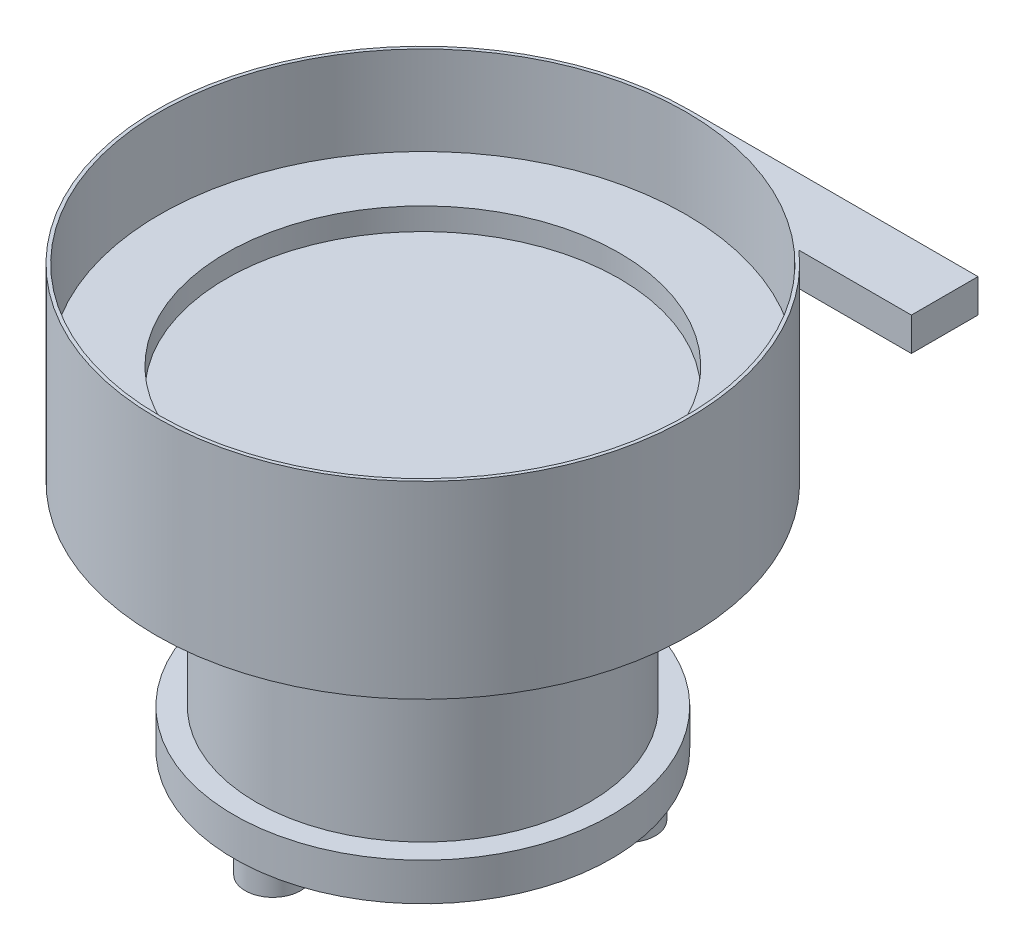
ISO-10303-21;
HEADER;
FILE_DESCRIPTION(('STEP AP214'),'2;1');
FILE_NAME('part.step','',(''),(''),'','','');
FILE_SCHEMA(('AUTOMOTIVE_DESIGN { 1 0 10303 214 1 1 1 1 }'));
ENDSEC;
DATA;
#1=APPLICATION_CONTEXT('core data for automotive mechanical design processes');
#2=APPLICATION_PROTOCOL_DEFINITION('international standard','automotive_design',2000,#1);
#3=PRODUCT_CONTEXT('',#1,'mechanical');
#4=PRODUCT('Part','Part','',(#3));
#5=PRODUCT_RELATED_PRODUCT_CATEGORY('part','',(#4));
#6=PRODUCT_DEFINITION_FORMATION('','',#4);
#7=PRODUCT_DEFINITION_CONTEXT('part definition',#1,'design');
#8=PRODUCT_DEFINITION('design','',#6,#7);
#9=PRODUCT_DEFINITION_SHAPE('','',#8);
#10=(LENGTH_UNIT() NAMED_UNIT(*) SI_UNIT(.MILLI.,.METRE.));
#11=(NAMED_UNIT(*) PLANE_ANGLE_UNIT() SI_UNIT($,.RADIAN.));
#12=(NAMED_UNIT(*) SI_UNIT($,.STERADIAN.) SOLID_ANGLE_UNIT());
#13=UNCERTAINTY_MEASURE_WITH_UNIT(LENGTH_MEASURE(1.E-05),#10,'distance_accuracy_value','');
#14=(GEOMETRIC_REPRESENTATION_CONTEXT(3) GLOBAL_UNCERTAINTY_ASSIGNED_CONTEXT((#13)) GLOBAL_UNIT_ASSIGNED_CONTEXT((#10,
#11,#12)) REPRESENTATION_CONTEXT('',''));
#15=CARTESIAN_POINT('',(0.,0.,0.));
#16=DIRECTION('',(0.,0.,1.));
#17=DIRECTION('',(1.,0.,0.));
#18=AXIS2_PLACEMENT_3D('',#15,#16,#17);
#19=CARTESIAN_POINT('',(0.,0.,0.));
#20=DIRECTION('',(0.,-1.,0.));
#21=DIRECTION('',(0.,0.,-1.));
#22=AXIS2_PLACEMENT_3D('',#19,#20,#21);
#23=CYLINDRICAL_SURFACE('',#22,240.);
#24=CARTESIAN_POINT('',(0.,209.,0.));
#25=DIRECTION('',(0.,-1.,0.));
#26=DIRECTION('',(0.,0.,-1.));
#27=AXIS2_PLACEMENT_3D('',#24,#25,#26);
#28=CIRCLE('',#27,240.);
#29=CARTESIAN_POINT('',(0.,209.,-240.));
#30=VERTEX_POINT('',#29);
#31=EDGE_CURVE('E114',#30,#30,#28,.T.);
#32=ORIENTED_EDGE('',*,*,#31,.F.);
#33=EDGE_LOOP('',(#32));
#34=FACE_BOUND('',#33,.T.);
#35=CARTESIAN_POINT('',(0.,349.,0.));
#36=DIRECTION('',(0.,1.,0.));
#37=DIRECTION('',(0.,0.,1.));
#38=AXIS2_PLACEMENT_3D('',#35,#36,#37);
#39=CIRCLE('',#38,240.);
#40=CARTESIAN_POINT('',(0.,349.,-240.));
#41=VERTEX_POINT('',#40);
#42=CARTESIAN_POINT('',(158.745078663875,349.,-180.));
#43=VERTEX_POINT('',#42);
#44=EDGE_CURVE('E73',#41,#43,#39,.F.);
#45=ORIENTED_EDGE('',*,*,#44,.T.);
#46=DIRECTION('',(0.,-1.,0.));
#47=VECTOR('',#46,1.);
#48=CARTESIAN_POINT('',(158.745078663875,0.,-180.));
#49=LINE('',#48,#47);
#50=CARTESIAN_POINT('',(158.745078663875,379.,-180.));
#51=VERTEX_POINT('',#50);
#52=EDGE_CURVE('E38',#43,#51,#49,.F.);
#53=ORIENTED_EDGE('',*,*,#52,.T.);
#54=CARTESIAN_POINT('',(0.,379.,0.));
#55=DIRECTION('',(0.,-1.,0.));
#56=DIRECTION('',(0.,0.,-1.));
#57=AXIS2_PLACEMENT_3D('',#54,#55,#56);
#58=CIRCLE('',#57,240.);
#59=CARTESIAN_POINT('',(0.,379.,-240.));
#60=VERTEX_POINT('',#59);
#61=EDGE_CURVE('E109',#51,#60,#58,.T.);
#62=ORIENTED_EDGE('',*,*,#61,.T.);
#63=DIRECTION('',(0.,1.,0.));
#64=VECTOR('',#63,1.);
#65=CARTESIAN_POINT('',(0.,379.,-240.));
#66=LINE('',#65,#64);
#67=EDGE_CURVE('E70',#41,#60,#66,.T.);
#68=ORIENTED_EDGE('',*,*,#67,.F.);
#69=EDGE_LOOP('',(#45,#53,#62,#68));
#70=FACE_BOUND('',#69,.T.);
#71=ADVANCED_FACE('F15',(#34,#70),#23,.T.);
#72=CARTESIAN_POINT('',(0.,299.,0.));
#73=DIRECTION('',(0.,1.,0.));
#74=DIRECTION('',(0.,0.,1.));
#75=AXIS2_PLACEMENT_3D('',#72,#73,#74);
#76=CYLINDRICAL_SURFACE('',#75,237.);
#77=CARTESIAN_POINT('',(0.,299.,0.));
#78=DIRECTION('',(0.,1.,0.));
#79=DIRECTION('',(0.,0.,1.));
#80=AXIS2_PLACEMENT_3D('',#77,#78,#79);
#81=CIRCLE('',#80,237.);
#82=CARTESIAN_POINT('',(0.,299.,237.));
#83=VERTEX_POINT('',#82);
#84=EDGE_CURVE('E88',#83,#83,#81,.T.);
#85=ORIENTED_EDGE('',*,*,#84,.F.);
#86=EDGE_LOOP('',(#85));
#87=FACE_BOUND('',#86,.T.);
#88=CARTESIAN_POINT('',(0.,379.,0.));
#89=DIRECTION('',(0.,1.,0.));
#90=DIRECTION('',(0.,0.,1.));
#91=AXIS2_PLACEMENT_3D('',#88,#89,#90);
#92=CIRCLE('',#91,237.);
#93=CARTESIAN_POINT('',(0.,379.,237.));
#94=VERTEX_POINT('',#93);
#95=EDGE_CURVE('E85',#94,#94,#92,.T.);
#96=ORIENTED_EDGE('',*,*,#95,.T.);
#97=EDGE_LOOP('',(#96));
#98=FACE_BOUND('',#97,.T.);
#99=ADVANCED_FACE('F143',(#87,#98),#76,.F.);
#100=CARTESIAN_POINT('',(0.,0.,0.));
#101=DIRECTION('',(0.,-1.,0.));
#102=DIRECTION('',(0.,0.,-1.));
#103=AXIS2_PLACEMENT_3D('',#100,#101,#102);
#104=PLANE('',#103);
#105=CARTESIAN_POINT('',(-116.913429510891,0.,-67.500000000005));
#106=DIRECTION('',(0.,-1.,0.));
#107=DIRECTION('',(0.,0.,-1.));
#108=AXIS2_PLACEMENT_3D('',#105,#106,#107);
#109=CIRCLE('',#108,25.);
#110=CARTESIAN_POINT('',(-116.913429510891,0.,-92.500000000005));
#111=VERTEX_POINT('',#110);
#112=EDGE_CURVE('E91',#111,#111,#109,.T.);
#113=ORIENTED_EDGE('',*,*,#112,.F.);
#114=EDGE_LOOP('',(#113));
#115=FACE_BOUND('',#114,.T.);
#116=CARTESIAN_POINT('',(116.913429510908,0.,-67.499999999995));
#117=DIRECTION('',(0.,-1.,0.));
#118=DIRECTION('',(0.,0.,-1.));
#119=AXIS2_PLACEMENT_3D('',#116,#117,#118);
#120=CIRCLE('',#119,25.);
#121=CARTESIAN_POINT('',(116.913429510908,0.,-92.499999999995));
#122=VERTEX_POINT('',#121);
#123=EDGE_CURVE('E97',#122,#122,#120,.T.);
#124=ORIENTED_EDGE('',*,*,#123,.F.);
#125=EDGE_LOOP('',(#124));
#126=FACE_BOUND('',#125,.T.);
#127=CARTESIAN_POINT('',(0.,0.,135.));
#128=DIRECTION('',(0.,-1.,0.));
#129=DIRECTION('',(0.,0.,-1.));
#130=AXIS2_PLACEMENT_3D('',#127,#128,#129);
#131=CIRCLE('',#130,25.);
#132=CARTESIAN_POINT('',(0.,0.,110.));
#133=VERTEX_POINT('',#132);
#134=EDGE_CURVE('E103',#133,#133,#131,.T.);
#135=ORIENTED_EDGE('',*,*,#134,.F.);
#136=EDGE_LOOP('',(#135));
#137=FACE_BOUND('',#136,.T.);
#138=CARTESIAN_POINT('',(0.,0.,0.));
#139=DIRECTION('',(0.,-1.,0.));
#140=DIRECTION('',(0.,0.,-1.));
#141=AXIS2_PLACEMENT_3D('',#138,#139,#140);
#142=CIRCLE('',#141,170.);
#143=CARTESIAN_POINT('',(0.,0.,-170.));
#144=VERTEX_POINT('',#143);
#145=EDGE_CURVE('E10',#144,#144,#142,.T.);
#146=ORIENTED_EDGE('',*,*,#145,.T.);
#147=EDGE_LOOP('',(#146));
#148=FACE_BOUND('',#147,.T.);
#149=ADVANCED_FACE('F17',(#115,#126,#137,#148),#104,.T.);
#150=CARTESIAN_POINT('',(0.,0.,0.));
#151=DIRECTION('',(0.,-1.,0.));
#152=DIRECTION('',(0.,0.,-1.));
#153=AXIS2_PLACEMENT_3D('',#150,#151,#152);
#154=CYLINDRICAL_SURFACE('',#153,170.);
#155=CARTESIAN_POINT('',(0.,34.,0.));
#156=DIRECTION('',(0.,-1.,0.));
#157=DIRECTION('',(0.,0.,-1.));
#158=AXIS2_PLACEMENT_3D('',#155,#156,#157);
#159=CIRCLE('',#158,170.);
#160=CARTESIAN_POINT('',(0.,34.,-170.));
#161=VERTEX_POINT('',#160);
#162=EDGE_CURVE('E23',#161,#161,#159,.T.);
#163=ORIENTED_EDGE('',*,*,#162,.T.);
#164=EDGE_LOOP('',(#163));
#165=FACE_BOUND('',#164,.T.);
#166=ORIENTED_EDGE('',*,*,#145,.F.);
#167=EDGE_LOOP('',(#166));
#168=FACE_BOUND('',#167,.T.);
#169=ADVANCED_FACE('F125',(#165,#168),#154,.T.);
#170=CARTESIAN_POINT('',(170.,34.,0.));
#171=DIRECTION('',(0.,1.,0.));
#172=DIRECTION('',(0.,0.,1.));
#173=AXIS2_PLACEMENT_3D('',#170,#171,#172);
#174=PLANE('',#173);
#175=CARTESIAN_POINT('',(0.,34.,0.));
#176=DIRECTION('',(0.,-1.,0.));
#177=DIRECTION('',(0.,0.,-1.));
#178=AXIS2_PLACEMENT_3D('',#175,#176,#177);
#179=CIRCLE('',#178,150.);
#180=CARTESIAN_POINT('',(0.,34.,-150.));
#181=VERTEX_POINT('',#180);
#182=EDGE_CURVE('E120',#181,#181,#179,.T.);
#183=ORIENTED_EDGE('',*,*,#182,.T.);
#184=EDGE_LOOP('',(#183));
#185=FACE_BOUND('',#184,.T.);
#186=ORIENTED_EDGE('',*,*,#162,.F.);
#187=EDGE_LOOP('',(#186));
#188=FACE_BOUND('',#187,.T.);
#189=ADVANCED_FACE('F128',(#185,#188),#174,.T.);
#190=CARTESIAN_POINT('',(0.,0.,0.));
#191=DIRECTION('',(0.,-1.,0.));
#192=DIRECTION('',(0.,0.,-1.));
#193=AXIS2_PLACEMENT_3D('',#190,#191,#192);
#194=CYLINDRICAL_SURFACE('',#193,150.);
#195=CARTESIAN_POINT('',(0.,209.,0.));
#196=DIRECTION('',(0.,-1.,0.));
#197=DIRECTION('',(0.,0.,-1.));
#198=AXIS2_PLACEMENT_3D('',#195,#196,#197);
#199=CIRCLE('',#198,150.);
#200=CARTESIAN_POINT('',(0.,209.,-150.));
#201=VERTEX_POINT('',#200);
#202=EDGE_CURVE('E117',#201,#201,#199,.T.);
#203=ORIENTED_EDGE('',*,*,#202,.T.);
#204=EDGE_LOOP('',(#203));
#205=FACE_BOUND('',#204,.T.);
#206=ORIENTED_EDGE('',*,*,#182,.F.);
#207=EDGE_LOOP('',(#206));
#208=FACE_BOUND('',#207,.T.);
#209=ADVANCED_FACE('F130',(#205,#208),#194,.T.);
#210=CARTESIAN_POINT('',(150.,209.,0.));
#211=DIRECTION('',(0.,-1.,0.));
#212=DIRECTION('',(0.,0.,-1.));
#213=AXIS2_PLACEMENT_3D('',#210,#211,#212);
#214=PLANE('',#213);
#215=ORIENTED_EDGE('',*,*,#31,.T.);
#216=EDGE_LOOP('',(#215));
#217=FACE_BOUND('',#216,.T.);
#218=ORIENTED_EDGE('',*,*,#202,.F.);
#219=EDGE_LOOP('',(#218));
#220=FACE_BOUND('',#219,.T.);
#221=ADVANCED_FACE('F139',(#217,#220),#214,.T.);
#222=CARTESIAN_POINT('',(240.,379.,0.));
#223=DIRECTION('',(0.,1.,0.));
#224=DIRECTION('',(0.,0.,1.));
#225=AXIS2_PLACEMENT_3D('',#222,#223,#224);
#226=PLANE('',#225);
#227=ORIENTED_EDGE('',*,*,#95,.F.);
#228=EDGE_LOOP('',(#227));
#229=FACE_BOUND('',#228,.T.);
#230=ORIENTED_EDGE('',*,*,#61,.F.);
#231=DIRECTION('',(-1.,0.,0.));
#232=VECTOR('',#231,1.);
#233=CARTESIAN_POINT('',(260.,379.,-180.));
#234=LINE('',#233,#232);
#235=CARTESIAN_POINT('',(260.,379.,-180.));
#236=VERTEX_POINT('',#235);
#237=EDGE_CURVE('E180',#236,#51,#234,.T.);
#238=ORIENTED_EDGE('',*,*,#237,.F.);
#239=DIRECTION('',(0.,0.,1.));
#240=VECTOR('',#239,1.);
#241=CARTESIAN_POINT('',(260.,379.,-180.));
#242=LINE('',#241,#240);
#243=CARTESIAN_POINT('',(260.,379.,-240.));
#244=VERTEX_POINT('',#243);
#245=EDGE_CURVE('E68',#244,#236,#242,.T.);
#246=ORIENTED_EDGE('',*,*,#245,.F.);
#247=DIRECTION('',(-1.,0.,0.));
#248=VECTOR('',#247,1.);
#249=CARTESIAN_POINT('',(260.,379.,-240.));
#250=LINE('',#249,#248);
#251=EDGE_CURVE('E76',#244,#60,#250,.T.);
#252=ORIENTED_EDGE('',*,*,#251,.T.);
#253=EDGE_LOOP('',(#230,#238,#246,#252));
#254=FACE_BOUND('',#253,.T.);
#255=ADVANCED_FACE('F156',(#229,#254),#226,.T.);
#256=CARTESIAN_POINT('',(0.,-30.,135.));
#257=DIRECTION('',(0.,1.,0.));
#258=DIRECTION('',(0.,0.,1.));
#259=AXIS2_PLACEMENT_3D('',#256,#257,#258);
#260=CYLINDRICAL_SURFACE('',#259,25.);
#261=CARTESIAN_POINT('',(0.,-30.,135.));
#262=DIRECTION('',(0.,-1.,0.));
#263=DIRECTION('',(0.,0.,-1.));
#264=AXIS2_PLACEMENT_3D('',#261,#262,#263);
#265=CIRCLE('',#264,25.);
#266=CARTESIAN_POINT('',(0.,-30.,110.));
#267=VERTEX_POINT('',#266);
#268=EDGE_CURVE('E106',#267,#267,#265,.T.);
#269=ORIENTED_EDGE('',*,*,#268,.F.);
#270=EDGE_LOOP('',(#269));
#271=FACE_BOUND('',#270,.T.);
#272=ORIENTED_EDGE('',*,*,#134,.T.);
#273=EDGE_LOOP('',(#272));
#274=FACE_BOUND('',#273,.T.);
#275=ADVANCED_FACE('F164',(#271,#274),#260,.T.);
#276=CARTESIAN_POINT('',(0.,-30.,135.));
#277=DIRECTION('',(0.,-1.,0.));
#278=DIRECTION('',(0.,0.,-1.));
#279=AXIS2_PLACEMENT_3D('',#276,#277,#278);
#280=PLANE('',#279);
#281=ORIENTED_EDGE('',*,*,#268,.T.);
#282=EDGE_LOOP('',(#281));
#283=FACE_BOUND('',#282,.T.);
#284=ADVANCED_FACE('F174',(#283),#280,.T.);
#285=CARTESIAN_POINT('',(116.913429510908,-30.,-67.499999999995));
#286=DIRECTION('',(0.,1.,0.));
#287=DIRECTION('',(0.,0.,1.));
#288=AXIS2_PLACEMENT_3D('',#285,#286,#287);
#289=CYLINDRICAL_SURFACE('',#288,25.);
#290=CARTESIAN_POINT('',(116.913429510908,-30.,-67.499999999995));
#291=DIRECTION('',(0.,-1.,0.));
#292=DIRECTION('',(0.,0.,-1.));
#293=AXIS2_PLACEMENT_3D('',#290,#291,#292);
#294=CIRCLE('',#293,25.);
#295=CARTESIAN_POINT('',(116.913429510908,-30.,-92.499999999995));
#296=VERTEX_POINT('',#295);
#297=EDGE_CURVE('E100',#296,#296,#294,.T.);
#298=ORIENTED_EDGE('',*,*,#297,.F.);
#299=EDGE_LOOP('',(#298));
#300=FACE_BOUND('',#299,.T.);
#301=ORIENTED_EDGE('',*,*,#123,.T.);
#302=EDGE_LOOP('',(#301));
#303=FACE_BOUND('',#302,.T.);
#304=ADVANCED_FACE('F223',(#300,#303),#289,.T.);
#305=CARTESIAN_POINT('',(116.913429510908,-30.,-67.499999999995));
#306=DIRECTION('',(0.,-1.,0.));
#307=DIRECTION('',(0.,0.,-1.));
#308=AXIS2_PLACEMENT_3D('',#305,#306,#307);
#309=PLANE('',#308);
#310=ORIENTED_EDGE('',*,*,#297,.T.);
#311=EDGE_LOOP('',(#310));
#312=FACE_BOUND('',#311,.T.);
#313=ADVANCED_FACE('F219',(#312),#309,.T.);
#314=CARTESIAN_POINT('',(-116.913429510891,-30.,-67.500000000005));
#315=DIRECTION('',(0.,1.,0.));
#316=DIRECTION('',(0.,0.,1.));
#317=AXIS2_PLACEMENT_3D('',#314,#315,#316);
#318=CYLINDRICAL_SURFACE('',#317,25.);
#319=CARTESIAN_POINT('',(-116.913429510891,-30.,-67.500000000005));
#320=DIRECTION('',(0.,-1.,0.));
#321=DIRECTION('',(0.,0.,-1.));
#322=AXIS2_PLACEMENT_3D('',#319,#320,#321);
#323=CIRCLE('',#322,25.);
#324=CARTESIAN_POINT('',(-116.913429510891,-30.,-92.500000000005));
#325=VERTEX_POINT('',#324);
#326=EDGE_CURVE('E94',#325,#325,#323,.T.);
#327=ORIENTED_EDGE('',*,*,#326,.F.);
#328=EDGE_LOOP('',(#327));
#329=FACE_BOUND('',#328,.T.);
#330=ORIENTED_EDGE('',*,*,#112,.T.);
#331=EDGE_LOOP('',(#330));
#332=FACE_BOUND('',#331,.T.);
#333=ADVANCED_FACE('F215',(#329,#332),#318,.T.);
#334=CARTESIAN_POINT('',(-116.913429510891,-30.,-67.500000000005));
#335=DIRECTION('',(0.,-1.,0.));
#336=DIRECTION('',(0.,0.,-1.));
#337=AXIS2_PLACEMENT_3D('',#334,#335,#336);
#338=PLANE('',#337);
#339=ORIENTED_EDGE('',*,*,#326,.T.);
#340=EDGE_LOOP('',(#339));
#341=FACE_BOUND('',#340,.T.);
#342=ADVANCED_FACE('F210',(#341),#338,.T.);
#343=CARTESIAN_POINT('',(0.,299.,0.));
#344=DIRECTION('',(0.,1.,0.));
#345=DIRECTION('',(0.,0.,1.));
#346=AXIS2_PLACEMENT_3D('',#343,#344,#345);
#347=PLANE('',#346);
#348=CARTESIAN_POINT('',(0.,299.,0.));
#349=DIRECTION('',(0.,1.,0.));
#350=DIRECTION('',(0.,0.,1.));
#351=AXIS2_PLACEMENT_3D('',#348,#349,#350);
#352=CIRCLE('',#351,177.);
#353=CARTESIAN_POINT('',(0.,299.,177.));
#354=VERTEX_POINT('',#353);
#355=EDGE_CURVE('E81',#354,#354,#352,.T.);
#356=ORIENTED_EDGE('',*,*,#355,.F.);
#357=EDGE_LOOP('',(#356));
#358=FACE_BOUND('',#357,.T.);
#359=ORIENTED_EDGE('',*,*,#84,.T.);
#360=EDGE_LOOP('',(#359));
#361=FACE_BOUND('',#360,.T.);
#362=ADVANCED_FACE('F207',(#358,#361),#347,.T.);
#363=CARTESIAN_POINT('',(0.,279.,0.));
#364=DIRECTION('',(0.,1.,0.));
#365=DIRECTION('',(0.,0.,1.));
#366=AXIS2_PLACEMENT_3D('',#363,#364,#365);
#367=CYLINDRICAL_SURFACE('',#366,177.);
#368=CARTESIAN_POINT('',(0.,279.,0.));
#369=DIRECTION('',(0.,1.,0.));
#370=DIRECTION('',(0.,0.,1.));
#371=AXIS2_PLACEMENT_3D('',#368,#369,#370);
#372=CIRCLE('',#371,177.);
#373=CARTESIAN_POINT('',(0.,279.,177.));
#374=VERTEX_POINT('',#373);
#375=EDGE_CURVE('E82',#374,#374,#372,.T.);
#376=ORIENTED_EDGE('',*,*,#375,.F.);
#377=EDGE_LOOP('',(#376));
#378=FACE_BOUND('',#377,.T.);
#379=ORIENTED_EDGE('',*,*,#355,.T.);
#380=EDGE_LOOP('',(#379));
#381=FACE_BOUND('',#380,.T.);
#382=ADVANCED_FACE('F203',(#378,#381),#367,.F.);
#383=CARTESIAN_POINT('',(0.,279.,0.));
#384=DIRECTION('',(0.,1.,0.));
#385=DIRECTION('',(0.,0.,1.));
#386=AXIS2_PLACEMENT_3D('',#383,#384,#385);
#387=PLANE('',#386);
#388=ORIENTED_EDGE('',*,*,#375,.T.);
#389=EDGE_LOOP('',(#388));
#390=FACE_BOUND('',#389,.T.);
#391=ADVANCED_FACE('F200',(#390),#387,.T.);
#392=CARTESIAN_POINT('',(260.,379.,-180.));
#393=DIRECTION('',(0.,0.,-1.));
#394=DIRECTION('',(-1.,0.,0.));
#395=AXIS2_PLACEMENT_3D('',#392,#393,#394);
#396=PLANE('',#395);
#397=ORIENTED_EDGE('',*,*,#52,.F.);
#398=DIRECTION('',(-1.,0.,0.));
#399=VECTOR('',#398,1.);
#400=CARTESIAN_POINT('',(260.,349.,-180.));
#401=LINE('',#400,#399);
#402=CARTESIAN_POINT('',(260.,349.,-180.));
#403=VERTEX_POINT('',#402);
#404=EDGE_CURVE('E59',#403,#43,#401,.T.);
#405=ORIENTED_EDGE('',*,*,#404,.F.);
#406=DIRECTION('',(0.,-1.,0.));
#407=VECTOR('',#406,1.);
#408=CARTESIAN_POINT('',(260.,379.,-180.));
#409=LINE('',#408,#407);
#410=EDGE_CURVE('E63',#236,#403,#409,.T.);
#411=ORIENTED_EDGE('',*,*,#410,.F.);
#412=ORIENTED_EDGE('',*,*,#237,.T.);
#413=EDGE_LOOP('',(#397,#405,#411,#412));
#414=FACE_BOUND('',#413,.T.);
#415=ADVANCED_FACE('F72',(#414),#396,.F.);
#416=CARTESIAN_POINT('',(260.,349.,-180.));
#417=DIRECTION('',(0.,1.,0.));
#418=DIRECTION('',(0.,0.,1.));
#419=AXIS2_PLACEMENT_3D('',#416,#417,#418);
#420=PLANE('',#419);
#421=ORIENTED_EDGE('',*,*,#44,.F.);
#422=DIRECTION('',(-1.,0.,0.));
#423=VECTOR('',#422,1.);
#424=CARTESIAN_POINT('',(260.,349.,-240.));
#425=LINE('',#424,#423);
#426=CARTESIAN_POINT('',(260.,349.,-240.));
#427=VERTEX_POINT('',#426);
#428=EDGE_CURVE('E30',#427,#41,#425,.T.);
#429=ORIENTED_EDGE('',*,*,#428,.F.);
#430=DIRECTION('',(0.,0.,-1.));
#431=VECTOR('',#430,1.);
#432=CARTESIAN_POINT('',(260.,349.,-180.));
#433=LINE('',#432,#431);
#434=EDGE_CURVE('E56',#403,#427,#433,.T.);
#435=ORIENTED_EDGE('',*,*,#434,.F.);
#436=ORIENTED_EDGE('',*,*,#404,.T.);
#437=EDGE_LOOP('',(#421,#429,#435,#436));
#438=FACE_BOUND('',#437,.T.);
#439=ADVANCED_FACE('F58',(#438),#420,.F.);
#440=CARTESIAN_POINT('',(260.,379.,-240.));
#441=DIRECTION('',(0.,0.,1.));
#442=DIRECTION('',(1.,0.,0.));
#443=AXIS2_PLACEMENT_3D('',#440,#441,#442);
#444=PLANE('',#443);
#445=ORIENTED_EDGE('',*,*,#67,.T.);
#446=ORIENTED_EDGE('',*,*,#251,.F.);
#447=DIRECTION('',(0.,1.,0.));
#448=VECTOR('',#447,1.);
#449=CARTESIAN_POINT('',(260.,379.,-240.));
#450=LINE('',#449,#448);
#451=EDGE_CURVE('E62',#427,#244,#450,.T.);
#452=ORIENTED_EDGE('',*,*,#451,.F.);
#453=ORIENTED_EDGE('',*,*,#428,.T.);
#454=EDGE_LOOP('',(#445,#446,#452,#453));
#455=FACE_BOUND('',#454,.T.);
#456=ADVANCED_FACE('F187',(#455),#444,.F.);
#457=CARTESIAN_POINT('',(260.,0.,0.));
#458=DIRECTION('',(1.,0.,0.));
#459=DIRECTION('',(0.,0.,-1.));
#460=AXIS2_PLACEMENT_3D('',#457,#458,#459);
#461=PLANE('',#460);
#462=ORIENTED_EDGE('',*,*,#410,.T.);
#463=ORIENTED_EDGE('',*,*,#434,.T.);
#464=ORIENTED_EDGE('',*,*,#451,.T.);
#465=ORIENTED_EDGE('',*,*,#245,.T.);
#466=EDGE_LOOP('',(#462,#463,#464,#465));
#467=FACE_BOUND('',#466,.T.);
#468=ADVANCED_FACE('F66',(#467),#461,.T.);
#469=CLOSED_SHELL('',(#71,#99,#149,#169,#189,#209,#221,#255,#275,#284,#304,#313,#333,#342,#362,
#382,#391,#415,#439,#456,#468));
#470=MANIFOLD_SOLID_BREP('B1',#469);
#471=ADVANCED_BREP_SHAPE_REPRESENTATION('',(#18,#470),#14);
#472=SHAPE_DEFINITION_REPRESENTATION(#9,#471);
ENDSEC;
END-ISO-10303-21;
